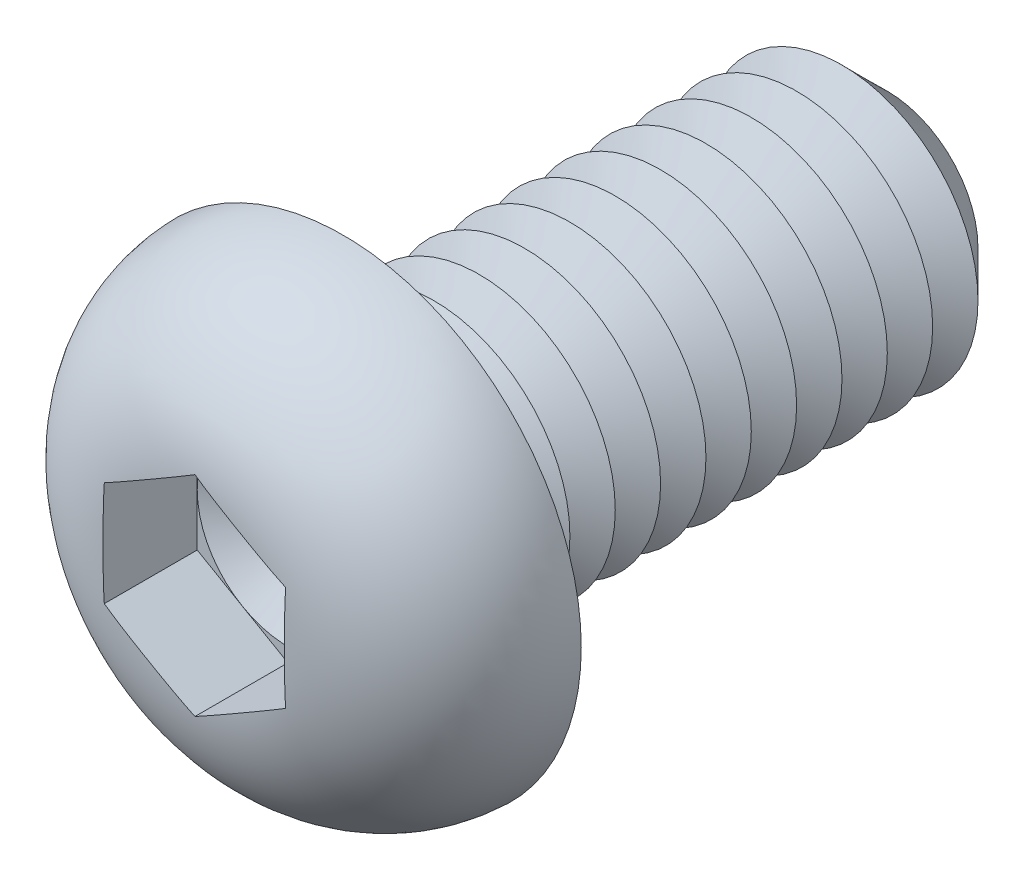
from build123d import *

# Parameters (mm, degrees)
CUT_EXTRUDE1_DEPTH  = 2.08
SKETCH4_R           = 3
BOSS_EXTRUDE1_DEPTH = 12
CHAMFER1_SIZE       = 1
LPATTERN1_COUNT     = 10
LPATTERN1_PITCH     = 1
FILLET2_R           = 0.5


with BuildPart() as part:
    # Sketch2 → Revolve1 (revolve)
    with BuildSketch(Plane(origin=(0, 0, 0), x_dir=(0, 0, -1), z_dir=(1, 0, 0)), mode=Mode.PRIVATE) as revolve1_sk:
        with BuildLine():
            Line((0, 0), (-3.3, 0))
            Line((-3.3, 0), (-3.3, 1.851470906))
            ThreePointArc((-3.3, 1.851470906), (-2.339262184, 4.220014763), (0, 5.25))
            Line((0, 5.25), (0, 0))
        make_face()
    revolve(revolve1_sk.sketch.rotate(Axis((0, 0, 47.934239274), (0, 0, -1)), 90), axis=Axis((0, 0, 47.934239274), (0, 0, -1)))

    # Sketch3 → Cut-Extrude1 (cut)
    with BuildSketch(Plane.XY.offset(3.3)):
        Polygon((0, 2.309401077), (-2, 1.154700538), (-2, -1.154700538), (0, -2.309401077), (2, -1.154700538), (2, 1.154700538), align=None)
    extrude(amount=-CUT_EXTRUDE1_DEPTH, mode=Mode.SUBTRACT)

    # Sketch4 → Boss-Extrude1 (add)
    with BuildSketch(Plane(origin=(0, 0, 0), x_dir=(-1, 0, 0), z_dir=(0, 0, -1))):
        Circle(SKETCH4_R)
    extrude(amount=BOSS_EXTRUDE1_DEPTH)

    # Chamfer1
    chamfer1_edges = [part.edges().sort_by_distance(p)[0] for p in [
        (3, 0, -12),
    ]]
    chamfer(chamfer1_edges, length=CHAMFER1_SIZE)

    # Sketch5 → Cut-Revolve1 (revolve, cut)
    with BuildSketch(Plane(origin=(0, 0, 0), x_dir=(0, 0, -1), z_dir=(1, 0, 0)), mode=Mode.PRIVATE) as cut_revolve1_sk:
        Polygon((1, 3), (2, 3), (1.5, 2.133974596), align=None)
    cut_revolve1 = revolve(cut_revolve1_sk.sketch.rotate(Axis((0, 0, 47.934239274), (0, 0, -1)), 90), axis=Axis((0, 0, 47.934239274), (0, 0, -1)), mode=Mode.SUBTRACT)

    # LPattern1: Cut-Revolve1 ×10
    with Locations(*[(0, 0, -i * LPATTERN1_PITCH) for i in range(1, LPATTERN1_COUNT)]):
        add(cut_revolve1, mode=Mode.SUBTRACT)

    # Fillet2
    fillet2_edges = [part.edges().sort_by_distance(p)[0] for p in [
        (3, 0, 0),
    ]]
    fillet(fillet2_edges, radius=FILLET2_R)

    # Cut-Extrude2 cone 1 section (on through the dimple's axis) → Cut-Extrude2 (revolve, cut)
    with BuildSketch(Plane(origin=(0, 0, 1.22), x_dir=(0, -1, 0), z_dir=(1, 0, 0))):
        Polygon((0, 0), (2, 0), (0, 1.154700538), align=None)
    revolve(axis=Axis((0, 0, 1.22), (0, 0, -1)), mode=Mode.SUBTRACT)


solid = part.part
